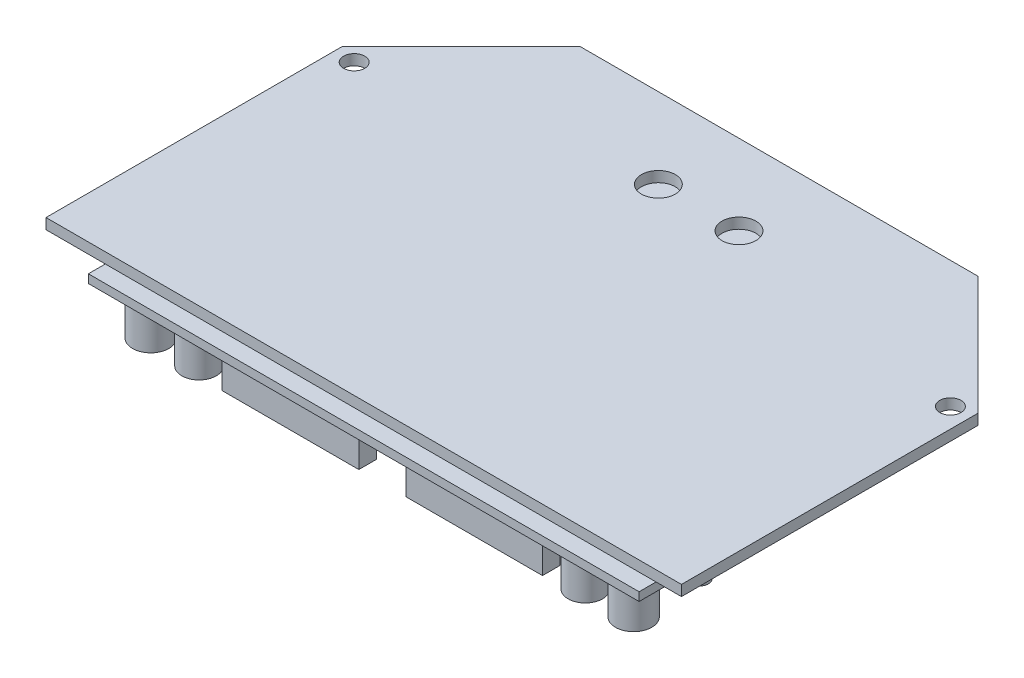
from build123d import *

# Parameters (mm, degrees)
ESQUISSE1_R             = 4
ESQUISSE1_R_2           = 2.5
BOSS_EXTRU_1_DEPTH      = 2.5
BOSS_EXTRU_2_START      = 4
BOSS_EXTRU_2_DEPTH      = 2
ESQUISSE3_R             = 4.687465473
ESQUISSE3_R_2           = 4.56961559
ESQUISSE3_R_3           = 4.38885108
ESQUISSE3_R_4           = 3.918988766
ESQUISSE3_R_5           = 1.566725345
ESQUISSE3_R_6           = 1.958406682
ESQUISSE3_R_7           = 2.093469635
ESQUISSE3_R_8           = 4.573299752
ESQUISSE3_R_9           = 3.266563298
ESQUISSE3_R_10          = 2.416388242
ESQUISSE3_R_11          = 4.288744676
ESQUISSE3_R_12          = 4.065155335
ESQUISSE3_W             = 32.248430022
ESQUISSE3_H             = 4.177934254
BOSS_EXTRU_3_DEPTH      = 10.5
ESQUISSE5_W             = 16.811335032
ESQUISSE5_H             = 6.688380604
ESQUISSE5_H_2           = 6.869147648
ESQUISSE5_H_3           = 7.230681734
ESQUISSE5_H_4           = 7.592215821
BOSS_EXTRU_4_DEPTH      = 3
ESQUISSE6_W             = 10
ESQUISSE6_H             = 20
ENL_V_MAT_EXTRU_1_DEPTH = 100.489949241


with BuildPart() as part:
    # Esquisse1 → Boss.-Extru.1 (new body)
    with BuildSketch(Plane(origin=(0, 0, 0), x_dir=(1, 0, 0), z_dir=(0, 1, 0))):
        Polygon((-85, -49), (0, -49), (0, 49), (-47, 49), (-75, 21), (-75, -29), (-85, -29), align=None)
        with Locations(Location((-9.513040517, 30.061343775, 0), (0, 0, 270))):
            Circle(ESQUISSE1_R, mode=Mode.SUBTRACT)
        with Locations(Location((-70.368600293, 19.115819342, 0), (0, 0, 270))):
            Circle(ESQUISSE1_R_2, mode=Mode.SUBTRACT)
        with Locations(Location((-78, -38, 0), (0, 0, 270))):
            Circle(ESQUISSE1_R_2, mode=Mode.SUBTRACT)
    boss_extru_1 = extrude(amount=-BOSS_EXTRU_1_DEPTH)

    # Esquisse5 → Boss.-Extru.4 (add)
    with BuildSketch(Plane.XZ.offset(2.5)):
        Polygon((-64.71460152, -23.590099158), (-59.29159022, -29.013110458), (-47.45134888, -17.172869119), (-52.874360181, -11.749857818), align=None)
        with Locations((-62.635780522, 39.226448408)):
            Rectangle(ESQUISSE5_W, ESQUISSE5_H)
        with Locations((-62.635780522, 24.313167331)):
            Rectangle(ESQUISSE5_W, ESQUISSE5_H_2)
        with Locations((-62.635780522, 10.394104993)):
            Rectangle(ESQUISSE5_W, ESQUISSE5_H_3)
        with Locations((-62.635780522, -4.971093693)):
            Rectangle(ESQUISSE5_W, ESQUISSE5_H_4)
        Polygon((-53.37146955, -36.243792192), (-47.45134888, -42.163912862), (-34.775059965, -29.487623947), (-40.695180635, -23.567503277), align=None)
    boss_extru_4 = extrude(amount=BOSS_EXTRU_4_DEPTH)


with BuildPart() as body_2:
    # Esquisse2 → Boss.-Extru.2 (new body)
    with BuildSketch(Plane.XZ.offset(2.5).offset(BOSS_EXTRU_2_START)):
        Polygon((-65, 49), (-65, -12.615223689), (-28.615223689, -49), (0, -49), (0, 49), align=None)
    boss_extru_2 = extrude(amount=BOSS_EXTRU_2_DEPTH)

    # Esquisse3 → Boss.-Extru.3 (add)
    with BuildSketch(Plane.XZ.offset(8.5)):
        with Locations(Location((-25.896630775, -39.083783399, 0), (0, 0, 270))):
            Circle(ESQUISSE3_R)
        with Locations(Location((-10.847394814, -39.083783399, 0), (0, 0, 270))):
            Circle(ESQUISSE3_R_2)
        with Locations(Location((-22.134057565, 11.573492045, 0), (0, 0, 270))):
            Circle(ESQUISSE3_R_3)
        with Locations(Location((-10.847394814, -14.89751132, 0), (0, 0, 270))):
            Circle(ESQUISSE3_R_4)
        with Locations(Location((-37.801311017, -22.254487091, 0), (0, 0, 270))):
            Circle(ESQUISSE3_R_5)
        with Locations(Location((-56.210333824, 1.912019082, 0), (0, 0, 270))):
            Circle(ESQUISSE3_R_6)
        with Locations(Location((-56.993696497, 26.735529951, 0), (0, 0, 270))):
            Circle(ESQUISSE3_R_7)
        with Locations(Location((-48.131652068, -10.059021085, 0), (0, 0, 270))):
            Circle(ESQUISSE3_R_8)
        with Locations(Location((-52.70495182, 14.840055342, 0), (0, 0, 270))):
            Circle(ESQUISSE3_R_9)
        with Locations(Location((-49.438388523, 24.494799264, 0), (0, 0, 270))):
            Circle(ESQUISSE3_R_10)
        with Locations(Location((-56.993696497, 42.279853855, 0), (0, 0, 270))):
            Circle(ESQUISSE3_R_11)
        with Locations(Location((-45.590929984, 42.279853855, 0), (0, 0, 270))):
            Circle(ESQUISSE3_R_12)
        with Locations((-21.677096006, 42.516317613)):
            Rectangle(ESQUISSE3_W, ESQUISSE3_H)
    boss_extru_3 = extrude(amount=BOSS_EXTRU_3_DEPTH)


with BuildPart() as part_1:
    add(part.part)

    add(body_2.part)  # Sym_trie1 merges body 2
    # Sym_trie1: Boss.-Extru.1, Boss.-Extru.2, Boss.-Extru.3, Boss.-Extru.4 across plane
    add(boss_extru_1.mirror(Plane(origin=(0, 0, 0), x_dir=(0, 0, 1), z_dir=(1, 0, 0))))
    add(boss_extru_2.mirror(Plane(origin=(0, 0, 0), x_dir=(0, 0, 1), z_dir=(1, 0, 0))))
    add(boss_extru_3.mirror(Plane(origin=(0, 0, 0), x_dir=(0, 0, 1), z_dir=(1, 0, 0))))
    add(boss_extru_4.mirror(Plane(origin=(0, 0, 0), x_dir=(0, 0, 1), z_dir=(1, 0, 0))))

    # Esquisse6 → Enl_v. mat.-Extru.1 (cut, through all)
    with BuildSketch(Plane.XZ.offset(2.5)):
        with Locations((-80, 39)):
            Rectangle(ESQUISSE6_W, ESQUISSE6_H)
        with Locations((80, 39)):
            Rectangle(ESQUISSE6_W, ESQUISSE6_H)
    extrude(amount=-ENL_V_MAT_EXTRU_1_DEPTH, mode=Mode.SUBTRACT)


solid = part_1.part
